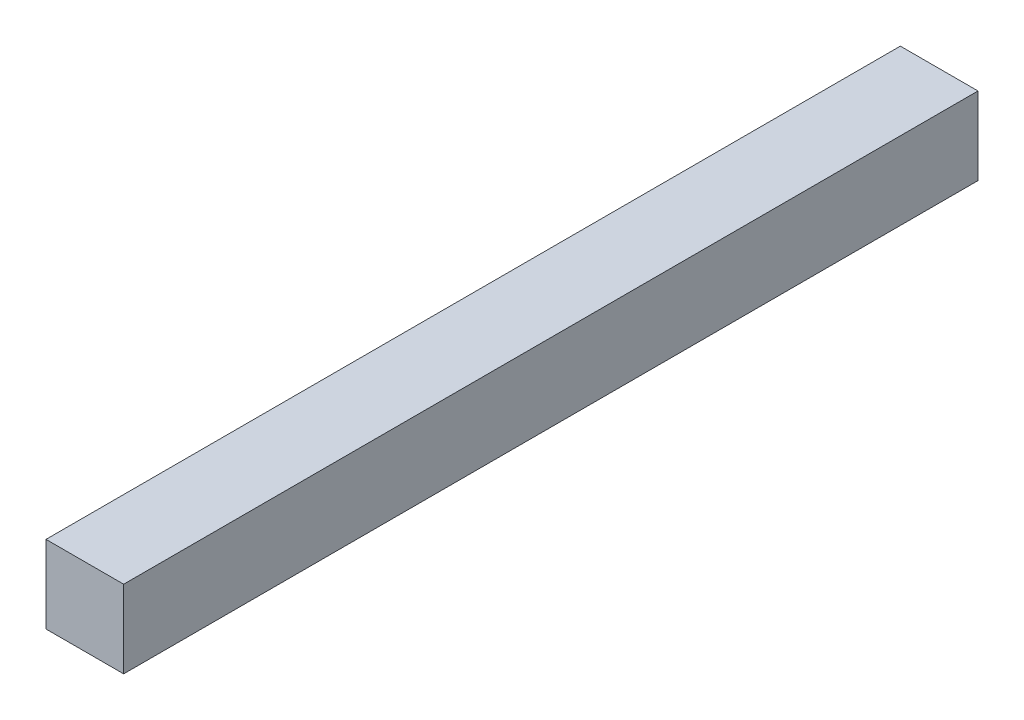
from build123d import *

# Parameters (mm, degrees)
SKETCH1_W           = 5
SKETCH1_H           = 5
BOSS_EXTRUDE1_DEPTH = 55


with BuildPart() as part:
    # Sketch1 → Boss-Extrude1 (new body)
    with BuildSketch(Plane.XY):
        Rectangle(SKETCH1_W, SKETCH1_H)
    extrude(amount=BOSS_EXTRUDE1_DEPTH)


solid = part.part
